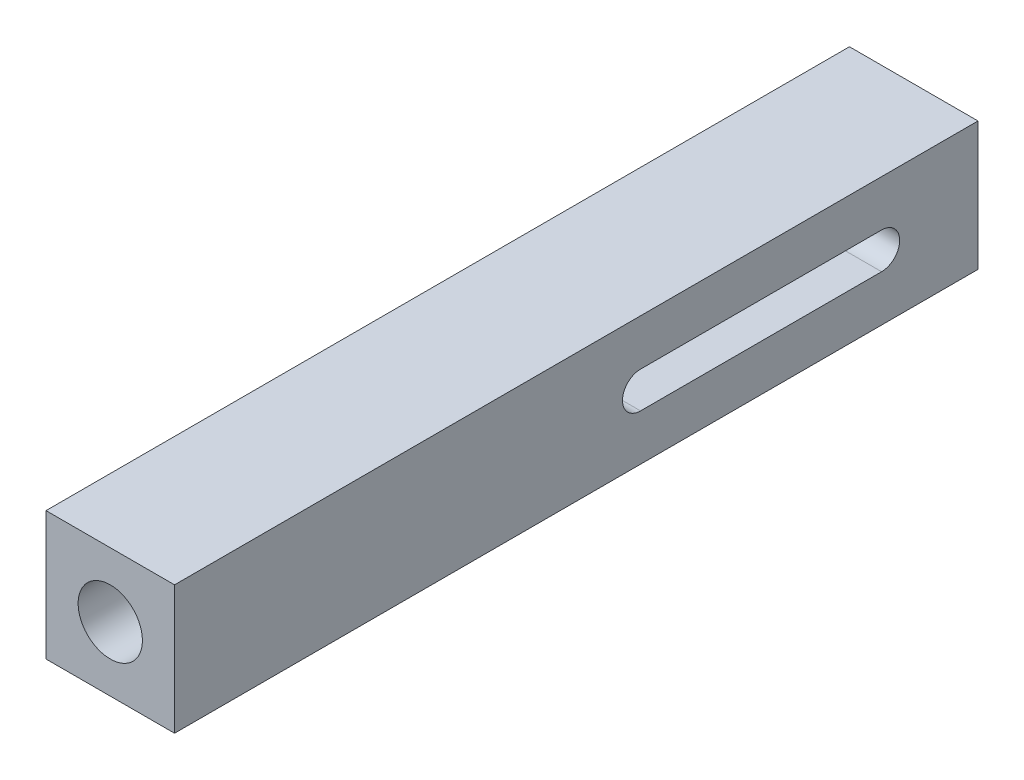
ISO-10303-21;
HEADER;
FILE_DESCRIPTION(('STEP AP214'),'2;1');
FILE_NAME('part.step','',(''),(''),'','','');
FILE_SCHEMA(('AUTOMOTIVE_DESIGN { 1 0 10303 214 1 1 1 1 }'));
ENDSEC;
DATA;
#1=APPLICATION_CONTEXT('core data for automotive mechanical design processes');
#2=APPLICATION_PROTOCOL_DEFINITION('international standard','automotive_design',2000,#1);
#3=PRODUCT_CONTEXT('',#1,'mechanical');
#4=PRODUCT('Part','Part','',(#3));
#5=PRODUCT_RELATED_PRODUCT_CATEGORY('part','',(#4));
#6=PRODUCT_DEFINITION_FORMATION('','',#4);
#7=PRODUCT_DEFINITION_CONTEXT('part definition',#1,'design');
#8=PRODUCT_DEFINITION('design','',#6,#7);
#9=PRODUCT_DEFINITION_SHAPE('','',#8);
#10=(LENGTH_UNIT() NAMED_UNIT(*) SI_UNIT(.MILLI.,.METRE.));
#11=(NAMED_UNIT(*) PLANE_ANGLE_UNIT() SI_UNIT($,.RADIAN.));
#12=(NAMED_UNIT(*) SI_UNIT($,.STERADIAN.) SOLID_ANGLE_UNIT());
#13=UNCERTAINTY_MEASURE_WITH_UNIT(LENGTH_MEASURE(1.E-05),#10,'distance_accuracy_value','');
#14=(GEOMETRIC_REPRESENTATION_CONTEXT(3) GLOBAL_UNCERTAINTY_ASSIGNED_CONTEXT((#13)) GLOBAL_UNIT_ASSIGNED_CONTEXT((#10,
#11,#12)) REPRESENTATION_CONTEXT('',''));
#15=CARTESIAN_POINT('',(0.,0.,0.));
#16=DIRECTION('',(0.,0.,1.));
#17=DIRECTION('',(1.,0.,0.));
#18=AXIS2_PLACEMENT_3D('',#15,#16,#17);
#19=CARTESIAN_POINT('',(0.,0.,100.));
#20=DIRECTION('',(0.,0.,1.));
#21=DIRECTION('',(1.,0.,0.));
#22=AXIS2_PLACEMENT_3D('',#19,#20,#21);
#23=PLANE('',#22);
#24=DIRECTION('',(0.,-1.,0.));
#25=VECTOR('',#24,1.);
#26=CARTESIAN_POINT('',(-8.,-8.,100.));
#27=LINE('',#26,#25);
#28=CARTESIAN_POINT('',(-8.,8.,100.));
#29=VERTEX_POINT('',#28);
#30=CARTESIAN_POINT('',(-8.,-8.,100.));
#31=VERTEX_POINT('',#30);
#32=EDGE_CURVE('E179',#29,#31,#27,.T.);
#33=ORIENTED_EDGE('',*,*,#32,.T.);
#34=DIRECTION('',(1.,0.,0.));
#35=VECTOR('',#34,1.);
#36=CARTESIAN_POINT('',(8.,-8.,100.));
#37=LINE('',#36,#35);
#38=CARTESIAN_POINT('',(8.,-8.,100.));
#39=VERTEX_POINT('',#38);
#40=EDGE_CURVE('E182',#31,#39,#37,.T.);
#41=ORIENTED_EDGE('',*,*,#40,.T.);
#42=DIRECTION('',(0.,1.,0.));
#43=VECTOR('',#42,1.);
#44=CARTESIAN_POINT('',(8.,-8.,100.));
#45=LINE('',#44,#43);
#46=CARTESIAN_POINT('',(8.,8.,100.));
#47=VERTEX_POINT('',#46);
#48=EDGE_CURVE('E185',#39,#47,#45,.T.);
#49=ORIENTED_EDGE('',*,*,#48,.T.);
#50=DIRECTION('',(-1.,0.,0.));
#51=VECTOR('',#50,1.);
#52=CARTESIAN_POINT('',(8.,8.,100.));
#53=LINE('',#52,#51);
#54=EDGE_CURVE('E187',#47,#29,#53,.T.);
#55=ORIENTED_EDGE('',*,*,#54,.T.);
#56=EDGE_LOOP('',(#33,#41,#49,#55));
#57=FACE_BOUND('',#56,.T.);
#58=CARTESIAN_POINT('',(0.,0.,100.));
#59=DIRECTION('',(0.,0.,1.));
#60=DIRECTION('',(1.,0.,0.));
#61=AXIS2_PLACEMENT_3D('',#58,#59,#60);
#62=CIRCLE('',#61,4.);
#63=CARTESIAN_POINT('',(4.,0.,100.));
#64=VERTEX_POINT('',#63);
#65=EDGE_CURVE('E173',#64,#64,#62,.T.);
#66=ORIENTED_EDGE('',*,*,#65,.F.);
#67=EDGE_LOOP('',(#66));
#68=FACE_BOUND('',#67,.T.);
#69=ADVANCED_FACE('F33',(#57,#68),#23,.T.);
#70=CARTESIAN_POINT('',(0.,0.,0.));
#71=DIRECTION('',(0.,0.,1.));
#72=DIRECTION('',(1.,0.,0.));
#73=AXIS2_PLACEMENT_3D('',#70,#71,#72);
#74=PLANE('',#73);
#75=DIRECTION('',(0.,-1.,0.));
#76=VECTOR('',#75,1.);
#77=CARTESIAN_POINT('',(-8.,-8.,0.));
#78=LINE('',#77,#76);
#79=CARTESIAN_POINT('',(-8.,8.,0.));
#80=VERTEX_POINT('',#79);
#81=CARTESIAN_POINT('',(-8.,-8.,0.));
#82=VERTEX_POINT('',#81);
#83=EDGE_CURVE('E176',#80,#82,#78,.T.);
#84=ORIENTED_EDGE('',*,*,#83,.F.);
#85=DIRECTION('',(-1.,0.,0.));
#86=VECTOR('',#85,1.);
#87=CARTESIAN_POINT('',(8.,8.,0.));
#88=LINE('',#87,#86);
#89=CARTESIAN_POINT('',(8.,8.,0.));
#90=VERTEX_POINT('',#89);
#91=EDGE_CURVE('E183',#90,#80,#88,.T.);
#92=ORIENTED_EDGE('',*,*,#91,.F.);
#93=DIRECTION('',(0.,1.,0.));
#94=VECTOR('',#93,1.);
#95=CARTESIAN_POINT('',(8.,-8.,0.));
#96=LINE('',#95,#94);
#97=CARTESIAN_POINT('',(8.,-8.,0.));
#98=VERTEX_POINT('',#97);
#99=EDGE_CURVE('E194',#98,#90,#96,.T.);
#100=ORIENTED_EDGE('',*,*,#99,.F.);
#101=DIRECTION('',(1.,0.,0.));
#102=VECTOR('',#101,1.);
#103=CARTESIAN_POINT('',(8.,-8.,0.));
#104=LINE('',#103,#102);
#105=EDGE_CURVE('E192',#82,#98,#104,.T.);
#106=ORIENTED_EDGE('',*,*,#105,.F.);
#107=EDGE_LOOP('',(#84,#92,#100,#106));
#108=FACE_BOUND('',#107,.T.);
#109=CARTESIAN_POINT('',(0.,0.,0.));
#110=DIRECTION('',(0.,0.,1.));
#111=DIRECTION('',(1.,0.,0.));
#112=AXIS2_PLACEMENT_3D('',#109,#110,#111);
#113=CIRCLE('',#112,4.);
#114=CARTESIAN_POINT('',(4.,0.,0.));
#115=VERTEX_POINT('',#114);
#116=EDGE_CURVE('E166',#115,#115,#113,.T.);
#117=ORIENTED_EDGE('',*,*,#116,.T.);
#118=EDGE_LOOP('',(#117));
#119=FACE_BOUND('',#118,.T.);
#120=ADVANCED_FACE('F260',(#108,#119),#74,.F.);
#121=CARTESIAN_POINT('',(-8.,-8.,100.));
#122=DIRECTION('',(1.,0.,0.));
#123=DIRECTION('',(0.,0.,-1.));
#124=AXIS2_PLACEMENT_3D('',#121,#122,#123);
#125=PLANE('',#124);
#126=DIRECTION('',(0.,0.,1.));
#127=VECTOR('',#126,1.);
#128=CARTESIAN_POINT('',(-8.,2.25,42.));
#129=LINE('',#128,#127);
#130=CARTESIAN_POINT('',(-8.,2.25,12.));
#131=VERTEX_POINT('',#130);
#132=CARTESIAN_POINT('',(-8.,2.25,42.));
#133=VERTEX_POINT('',#132);
#134=EDGE_CURVE('E149',#131,#133,#129,.T.);
#135=ORIENTED_EDGE('',*,*,#134,.T.);
#136=CARTESIAN_POINT('',(-8.,0.,42.));
#137=DIRECTION('',(1.,0.,0.));
#138=DIRECTION('',(0.,0.,-1.));
#139=AXIS2_PLACEMENT_3D('',#136,#137,#138);
#140=CIRCLE('',#139,2.25);
#141=CARTESIAN_POINT('',(-8.,-2.25000000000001,42.));
#142=VERTEX_POINT('',#141);
#143=EDGE_CURVE('E133',#133,#142,#140,.T.);
#144=ORIENTED_EDGE('',*,*,#143,.T.);
#145=DIRECTION('',(0.,0.,-1.));
#146=VECTOR('',#145,1.);
#147=CARTESIAN_POINT('',(-8.,-2.25000000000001,42.));
#148=LINE('',#147,#146);
#149=CARTESIAN_POINT('',(-8.,-2.25,12.));
#150=VERTEX_POINT('',#149);
#151=EDGE_CURVE('E142',#142,#150,#148,.T.);
#152=ORIENTED_EDGE('',*,*,#151,.T.);
#153=CARTESIAN_POINT('',(-8.,0.,12.));
#154=DIRECTION('',(1.,0.,0.));
#155=DIRECTION('',(0.,0.,-1.));
#156=AXIS2_PLACEMENT_3D('',#153,#154,#155);
#157=CIRCLE('',#156,2.25);
#158=EDGE_CURVE('E53',#150,#131,#157,.T.);
#159=ORIENTED_EDGE('',*,*,#158,.T.);
#160=EDGE_LOOP('',(#135,#144,#152,#159));
#161=FACE_BOUND('',#160,.T.);
#162=ORIENTED_EDGE('',*,*,#83,.T.);
#163=DIRECTION('',(0.,0.,-1.));
#164=VECTOR('',#163,1.);
#165=CARTESIAN_POINT('',(-8.,-8.,100.));
#166=LINE('',#165,#164);
#167=EDGE_CURVE('E205',#31,#82,#166,.T.);
#168=ORIENTED_EDGE('',*,*,#167,.F.);
#169=ORIENTED_EDGE('',*,*,#32,.F.);
#170=DIRECTION('',(0.,0.,-1.));
#171=VECTOR('',#170,1.);
#172=CARTESIAN_POINT('',(-8.,8.,100.));
#173=LINE('',#172,#171);
#174=EDGE_CURVE('E189',#29,#80,#173,.T.);
#175=ORIENTED_EDGE('',*,*,#174,.T.);
#176=EDGE_LOOP('',(#162,#168,#169,#175));
#177=FACE_BOUND('',#176,.T.);
#178=ADVANCED_FACE('F35',(#161,#177),#125,.F.);
#179=CARTESIAN_POINT('',(8.,-8.,100.));
#180=DIRECTION('',(0.,1.,0.));
#181=DIRECTION('',(-1.,0.,0.));
#182=AXIS2_PLACEMENT_3D('',#179,#180,#181);
#183=PLANE('',#182);
#184=ORIENTED_EDGE('',*,*,#105,.T.);
#185=DIRECTION('',(0.,0.,-1.));
#186=VECTOR('',#185,1.);
#187=CARTESIAN_POINT('',(8.,-8.,100.));
#188=LINE('',#187,#186);
#189=EDGE_CURVE('E202',#39,#98,#188,.T.);
#190=ORIENTED_EDGE('',*,*,#189,.F.);
#191=ORIENTED_EDGE('',*,*,#40,.F.);
#192=ORIENTED_EDGE('',*,*,#167,.T.);
#193=EDGE_LOOP('',(#184,#190,#191,#192));
#194=FACE_BOUND('',#193,.T.);
#195=ADVANCED_FACE('F275',(#194),#183,.F.);
#196=CARTESIAN_POINT('',(8.,-8.,100.));
#197=DIRECTION('',(-1.,0.,0.));
#198=DIRECTION('',(0.,0.,1.));
#199=AXIS2_PLACEMENT_3D('',#196,#197,#198);
#200=PLANE('',#199);
#201=DIRECTION('',(0.,0.,-1.));
#202=VECTOR('',#201,1.);
#203=CARTESIAN_POINT('',(8.,-2.25000000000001,42.));
#204=LINE('',#203,#202);
#205=CARTESIAN_POINT('',(8.,-2.25000000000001,42.));
#206=VERTEX_POINT('',#205);
#207=CARTESIAN_POINT('',(8.,-2.25,12.));
#208=VERTEX_POINT('',#207);
#209=EDGE_CURVE('E159',#206,#208,#204,.T.);
#210=ORIENTED_EDGE('',*,*,#209,.F.);
#211=CARTESIAN_POINT('',(8.,0.,42.));
#212=DIRECTION('',(1.,0.,0.));
#213=DIRECTION('',(0.,0.,-1.));
#214=AXIS2_PLACEMENT_3D('',#211,#212,#213);
#215=CIRCLE('',#214,2.25);
#216=CARTESIAN_POINT('',(8.,2.25,42.));
#217=VERTEX_POINT('',#216);
#218=EDGE_CURVE('E61',#217,#206,#215,.T.);
#219=ORIENTED_EDGE('',*,*,#218,.F.);
#220=DIRECTION('',(0.,0.,1.));
#221=VECTOR('',#220,1.);
#222=CARTESIAN_POINT('',(8.,2.25,42.));
#223=LINE('',#222,#221);
#224=CARTESIAN_POINT('',(8.,2.25,12.));
#225=VERTEX_POINT('',#224);
#226=EDGE_CURVE('E150',#225,#217,#223,.T.);
#227=ORIENTED_EDGE('',*,*,#226,.F.);
#228=CARTESIAN_POINT('',(8.,0.,12.));
#229=DIRECTION('',(1.,0.,0.));
#230=DIRECTION('',(0.,0.,-1.));
#231=AXIS2_PLACEMENT_3D('',#228,#229,#230);
#232=CIRCLE('',#231,2.25);
#233=EDGE_CURVE('E153',#208,#225,#232,.T.);
#234=ORIENTED_EDGE('',*,*,#233,.F.);
#235=EDGE_LOOP('',(#210,#219,#227,#234));
#236=FACE_BOUND('',#235,.T.);
#237=ORIENTED_EDGE('',*,*,#99,.T.);
#238=DIRECTION('',(0.,0.,-1.));
#239=VECTOR('',#238,1.);
#240=CARTESIAN_POINT('',(8.,8.,100.));
#241=LINE('',#240,#239);
#242=EDGE_CURVE('E199',#47,#90,#241,.T.);
#243=ORIENTED_EDGE('',*,*,#242,.F.);
#244=ORIENTED_EDGE('',*,*,#48,.F.);
#245=ORIENTED_EDGE('',*,*,#189,.T.);
#246=EDGE_LOOP('',(#237,#243,#244,#245));
#247=FACE_BOUND('',#246,.T.);
#248=ADVANCED_FACE('F272',(#236,#247),#200,.F.);
#249=CARTESIAN_POINT('',(8.,8.,100.));
#250=DIRECTION('',(0.,-1.,0.));
#251=DIRECTION('',(1.,0.,0.));
#252=AXIS2_PLACEMENT_3D('',#249,#250,#251);
#253=PLANE('',#252);
#254=ORIENTED_EDGE('',*,*,#91,.T.);
#255=ORIENTED_EDGE('',*,*,#174,.F.);
#256=ORIENTED_EDGE('',*,*,#54,.F.);
#257=ORIENTED_EDGE('',*,*,#242,.T.);
#258=EDGE_LOOP('',(#254,#255,#256,#257));
#259=FACE_BOUND('',#258,.T.);
#260=ADVANCED_FACE('F269',(#259),#253,.F.);
#261=CARTESIAN_POINT('',(0.,0.,100.));
#262=DIRECTION('',(0.,0.,-1.));
#263=DIRECTION('',(-1.,0.,0.));
#264=AXIS2_PLACEMENT_3D('',#261,#262,#263);
#265=CYLINDRICAL_SURFACE('',#264,4.);
#266=CARTESIAN_POINT('',(-3.30718913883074,2.25,42.));
#267=CARTESIAN_POINT('',(-3.30716787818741,2.25001185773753,42.0577125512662));
#268=CARTESIAN_POINT('',(-3.30869926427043,2.24777996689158,42.1154129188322));
#269=CARTESIAN_POINT('',(-3.31470622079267,2.23892257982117,42.2302752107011));
#270=CARTESIAN_POINT('',(-3.31917937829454,2.23230068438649,42.2874375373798));
#271=CARTESIAN_POINT('',(-3.33086768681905,2.2148190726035,42.4004040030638));
#272=CARTESIAN_POINT('',(-3.33806317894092,2.20398972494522,42.4562148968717));
#273=CARTESIAN_POINT('',(-3.35491430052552,2.17825313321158,42.5665008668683));
#274=CARTESIAN_POINT('',(-3.3645703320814,2.1633452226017,42.6209757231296));
#275=CARTESIAN_POINT('',(-3.39667177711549,2.11286872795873,42.781554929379));
#276=CARTESIAN_POINT('',(-3.42230049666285,2.07147734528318,42.8852547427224));
#277=CARTESIAN_POINT('',(-3.47909094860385,1.97460669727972,43.0843147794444));
#278=CARTESIAN_POINT('',(-3.51026361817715,1.91909948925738,43.1796579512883));
#279=CARTESIAN_POINT('',(-3.57858787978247,1.7887620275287,43.3702232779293));
#280=CARTESIAN_POINT('',(-3.61602340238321,1.71251246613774,43.4643753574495));
#281=CARTESIAN_POINT('',(-3.69037015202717,1.54580201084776,43.6393944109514));
#282=CARTESIAN_POINT('',(-3.7272812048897,1.45533651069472,43.7202570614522));
#283=CARTESIAN_POINT('',(-3.80043848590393,1.25271101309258,43.873709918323));
#284=CARTESIAN_POINT('',(-3.83631726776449,1.13932505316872,43.9448737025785));
#285=CARTESIAN_POINT('',(-3.89944551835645,0.899786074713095,44.0666130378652));
#286=CARTESIAN_POINT('',(-3.9267016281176,0.773642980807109,44.1172044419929));
#287=CARTESIAN_POINT('',(-3.96741496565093,0.523682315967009,44.1917496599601));
#288=CARTESIAN_POINT('',(-3.98185952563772,0.400602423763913,44.2176244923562));
#289=CARTESIAN_POINT('',(-3.99909588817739,0.151077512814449,44.2484307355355));
#290=CARTESIAN_POINT('',(-4.00189688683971,0.0246352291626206,44.2533786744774));
#291=CARTESIAN_POINT('',(-3.99589301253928,-0.213147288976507,44.2426914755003));
#292=CARTESIAN_POINT('',(-3.98832416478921,-0.324626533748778,44.2292486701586));
#293=CARTESIAN_POINT('',(-3.96444049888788,-0.543436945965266,44.1862315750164));
#294=CARTESIAN_POINT('',(-3.94812513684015,-0.650767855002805,44.1566562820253));
#295=CARTESIAN_POINT('',(-3.90798974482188,-0.859682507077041,44.0822753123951));
#296=CARTESIAN_POINT('',(-3.88409832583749,-0.961200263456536,44.0373244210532));
#297=CARTESIAN_POINT('',(-3.83081335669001,-1.1554333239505,43.9338041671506));
#298=CARTESIAN_POINT('',(-3.80141814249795,-1.24814595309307,43.875230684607));
#299=CARTESIAN_POINT('',(-3.73587848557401,-1.43313450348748,43.7387534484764));
#300=CARTESIAN_POINT('',(-3.69934709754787,-1.52422336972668,43.6594268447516));
#301=CARTESIAN_POINT('',(-3.6254349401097,-1.69254024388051,43.4873861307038));
#302=CARTESIAN_POINT('',(-3.58805310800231,-1.76974969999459,43.3946543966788));
#303=CARTESIAN_POINT('',(-3.51260135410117,-1.91545866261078,43.1878583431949));
#304=CARTESIAN_POINT('',(-3.4748058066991,-1.98242527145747,43.0726029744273));
#305=CARTESIAN_POINT('',(-3.40783363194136,-2.09547542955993,42.8302176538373));
#306=CARTESIAN_POINT('',(-3.3786310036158,-2.14162220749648,42.7031250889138));
#307=CARTESIAN_POINT('',(-3.34054928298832,-2.20035516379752,42.4796115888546));
#308=CARTESIAN_POINT('',(-3.3282076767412,-2.21884315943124,42.3853277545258));
#309=CARTESIAN_POINT('',(-3.31568780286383,-2.23746879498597,42.2420198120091));
#310=CARTESIAN_POINT('',(-3.31251289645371,-2.24215984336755,42.1938137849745));
#311=CARTESIAN_POINT('',(-3.30825879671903,-2.24842833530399,42.0970776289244));
#312=CARTESIAN_POINT('',(-3.30718093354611,-2.25000380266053,42.0485473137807));
#313=CARTESIAN_POINT('',(-3.30718913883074,-2.25000000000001,42.));
#314=B_SPLINE_CURVE_WITH_KNOTS('',3,(#266,#267,#268,#269,#270,#271,#272,#273,#274,#275,#276,
#277,#278,#279,#280,#281,#282,#283,#284,#285,#286,#287,#288,#289,#290,#291,#292,#293,#294,#295,
#296,#297,#298,#299,#300,#301,#302,#303,#304,#305,#306,#307,#308,#309,#310,#311,#312,#313),
.UNSPECIFIED.,.F.,.F.,(4,2,2,2,2,2,2,2,2,2,2,2,2,2,2,2,2,2,2,2,2,2,2,4),(0.,0.173054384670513,
0.345967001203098,0.517654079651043,0.689369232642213,1.03146915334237,1.3742516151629,
1.75313175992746,2.13213492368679,2.54569337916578,2.9589325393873,3.3365326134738,
3.71383440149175,4.0498639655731,4.38591442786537,4.725230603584,5.06464953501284,
5.4416836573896,5.81921805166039,6.23275751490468,6.64503248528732,6.93453262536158,
7.0800126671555,7.22558495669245),.UNSPECIFIED.);
#315=CARTESIAN_POINT('',(-3.30718913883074,2.25,42.));
#316=VERTEX_POINT('',#315);
#317=CARTESIAN_POINT('',(-3.30718913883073,-2.25000000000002,42.));
#318=VERTEX_POINT('',#317);
#319=EDGE_CURVE('E11',#316,#318,#314,.T.);
#320=ORIENTED_EDGE('',*,*,#319,.F.);
#321=DIRECTION('',(0.,0.,-1.));
#322=VECTOR('',#321,1.);
#323=CARTESIAN_POINT('',(-3.30718913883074,2.24999999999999,100.));
#324=LINE('',#323,#322);
#325=CARTESIAN_POINT('',(-3.30718913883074,2.25,12.));
#326=VERTEX_POINT('',#325);
#327=EDGE_CURVE('E46',#326,#316,#324,.F.);
#328=ORIENTED_EDGE('',*,*,#327,.F.);
#329=CARTESIAN_POINT('',(-3.30718913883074,-2.25,12.));
#330=CARTESIAN_POINT('',(-3.30716787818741,-2.25001185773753,11.9422874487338));
#331=CARTESIAN_POINT('',(-3.30869926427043,-2.24777996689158,11.8845870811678));
#332=CARTESIAN_POINT('',(-3.31470622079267,-2.23892257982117,11.7697247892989));
#333=CARTESIAN_POINT('',(-3.31917937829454,-2.23230068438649,11.7125624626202));
#334=CARTESIAN_POINT('',(-3.33086768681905,-2.21481907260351,11.5995959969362));
#335=CARTESIAN_POINT('',(-3.33806317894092,-2.20398972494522,11.5437851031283));
#336=CARTESIAN_POINT('',(-3.35491430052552,-2.17825313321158,11.4334991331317));
#337=CARTESIAN_POINT('',(-3.3645703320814,-2.16334522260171,11.3790242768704));
#338=CARTESIAN_POINT('',(-3.39667177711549,-2.11286872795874,11.218445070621));
#339=CARTESIAN_POINT('',(-3.42230049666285,-2.07147734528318,11.1147452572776));
#340=CARTESIAN_POINT('',(-3.47909094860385,-1.97460669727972,10.9156852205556));
#341=CARTESIAN_POINT('',(-3.51026361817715,-1.91909948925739,10.8203420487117));
#342=CARTESIAN_POINT('',(-3.57858787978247,-1.78876202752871,10.6297767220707));
#343=CARTESIAN_POINT('',(-3.61602340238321,-1.71251246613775,10.5356246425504));
#344=CARTESIAN_POINT('',(-3.69037015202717,-1.54580201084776,10.3606055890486));
#345=CARTESIAN_POINT('',(-3.7272812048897,-1.45533651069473,10.2797429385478));
#346=CARTESIAN_POINT('',(-3.80043848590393,-1.25271101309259,10.126290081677));
#347=CARTESIAN_POINT('',(-3.83631726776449,-1.13932505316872,10.0551262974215));
#348=CARTESIAN_POINT('',(-3.89944551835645,-0.899786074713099,9.9333869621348));
#349=CARTESIAN_POINT('',(-3.9267016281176,-0.773642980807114,9.88279555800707));
#350=CARTESIAN_POINT('',(-3.96741496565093,-0.523682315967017,9.80825034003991));
#351=CARTESIAN_POINT('',(-3.98185952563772,-0.400602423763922,9.78237550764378));
#352=CARTESIAN_POINT('',(-3.99909588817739,-0.151077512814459,9.75156926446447));
#353=CARTESIAN_POINT('',(-4.00189688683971,-0.0246352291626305,9.74662132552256));
#354=CARTESIAN_POINT('',(-3.99589301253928,0.213147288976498,9.75730852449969));
#355=CARTESIAN_POINT('',(-3.98832416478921,0.324626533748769,9.77075132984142));
#356=CARTESIAN_POINT('',(-3.96444049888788,0.543436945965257,9.81376842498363));
#357=CARTESIAN_POINT('',(-3.94812513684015,0.650767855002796,9.84334371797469));
#358=CARTESIAN_POINT('',(-3.90798974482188,0.859682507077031,9.91772468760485));
#359=CARTESIAN_POINT('',(-3.88409832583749,0.961200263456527,9.96267557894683));
#360=CARTESIAN_POINT('',(-3.83081335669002,1.15543332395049,10.0661958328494));
#361=CARTESIAN_POINT('',(-3.80141814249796,1.24814595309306,10.124769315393));
#362=CARTESIAN_POINT('',(-3.73587848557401,1.43313450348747,10.2612465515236));
#363=CARTESIAN_POINT('',(-3.69934709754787,1.52422336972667,10.3405731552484));
#364=CARTESIAN_POINT('',(-3.62543494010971,1.6925402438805,10.5126138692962));
#365=CARTESIAN_POINT('',(-3.58805310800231,1.76974969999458,10.6053456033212));
#366=CARTESIAN_POINT('',(-3.51260135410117,1.91545866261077,10.8121416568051));
#367=CARTESIAN_POINT('',(-3.4748058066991,1.98242527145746,10.9273970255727));
#368=CARTESIAN_POINT('',(-3.40783363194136,2.09547542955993,11.1697823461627));
#369=CARTESIAN_POINT('',(-3.37863100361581,2.14162220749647,11.2968749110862));
#370=CARTESIAN_POINT('',(-3.34054928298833,2.20035516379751,11.5203884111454));
#371=CARTESIAN_POINT('',(-3.32820767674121,2.21884315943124,11.6146722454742));
#372=CARTESIAN_POINT('',(-3.31568780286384,2.23746879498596,11.7579801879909));
#373=CARTESIAN_POINT('',(-3.31251289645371,2.24215984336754,11.8061862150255));
#374=CARTESIAN_POINT('',(-3.30825879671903,2.24842833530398,11.9029223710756));
#375=CARTESIAN_POINT('',(-3.30718093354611,2.25000380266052,11.9514526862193));
#376=CARTESIAN_POINT('',(-3.30718913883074,2.25,12.));
#377=B_SPLINE_CURVE_WITH_KNOTS('',3,(#329,#330,#331,#332,#333,#334,#335,#336,#337,#338,#339,
#340,#341,#342,#343,#344,#345,#346,#347,#348,#349,#350,#351,#352,#353,#354,#355,#356,#357,#358,
#359,#360,#361,#362,#363,#364,#365,#366,#367,#368,#369,#370,#371,#372,#373,#374,#375,#376),
.UNSPECIFIED.,.F.,.F.,(4,2,2,2,2,2,2,2,2,2,2,2,2,2,2,2,2,2,2,2,2,2,2,4),(0.,0.173054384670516,
0.34596700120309,0.51765407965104,0.689369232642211,1.03146915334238,1.3742516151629,
1.75313175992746,2.13213492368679,2.54569337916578,2.95893253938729,3.33653261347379,
3.71383440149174,4.0498639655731,4.38591442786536,4.725230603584,5.06464953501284,
5.4416836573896,5.81921805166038,6.23275751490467,6.64503248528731,6.93453262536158,
7.0800126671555,7.22558495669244),.UNSPECIFIED.);
#378=CARTESIAN_POINT('',(-3.30718913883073,-2.25,12.));
#379=VERTEX_POINT('',#378);
#380=EDGE_CURVE('E232',#379,#326,#377,.T.);
#381=ORIENTED_EDGE('',*,*,#380,.F.);
#382=DIRECTION('',(0.,0.,-1.));
#383=VECTOR('',#382,1.);
#384=CARTESIAN_POINT('',(-3.30718913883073,-2.25000000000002,100.));
#385=LINE('',#384,#383);
#386=EDGE_CURVE('E237',#318,#379,#385,.T.);
#387=ORIENTED_EDGE('',*,*,#386,.F.);
#388=EDGE_LOOP('',(#320,#328,#381,#387));
#389=FACE_BOUND('',#388,.T.);
#390=CARTESIAN_POINT('',(3.30718913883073,-2.25000000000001,42.));
#391=CARTESIAN_POINT('',(3.3071678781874,-2.25001185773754,42.0577125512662));
#392=CARTESIAN_POINT('',(3.30869926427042,-2.24777996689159,42.1154129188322));
#393=CARTESIAN_POINT('',(3.31470622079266,-2.23892257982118,42.2302752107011));
#394=CARTESIAN_POINT('',(3.31917937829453,-2.2323006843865,42.2874375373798));
#395=CARTESIAN_POINT('',(3.33086768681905,-2.21481907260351,42.4004040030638));
#396=CARTESIAN_POINT('',(3.33806317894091,-2.20398972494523,42.4562148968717));
#397=CARTESIAN_POINT('',(3.35491430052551,-2.17825313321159,42.5665008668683));
#398=CARTESIAN_POINT('',(3.3645703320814,-2.16334522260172,42.6209757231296));
#399=CARTESIAN_POINT('',(3.39667177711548,-2.11286872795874,42.781554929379));
#400=CARTESIAN_POINT('',(3.42230049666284,-2.07147734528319,42.8852547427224));
#401=CARTESIAN_POINT('',(3.47909094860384,-1.97460669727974,43.0843147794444));
#402=CARTESIAN_POINT('',(3.51026361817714,-1.9190994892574,43.1796579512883));
#403=CARTESIAN_POINT('',(3.57858787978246,-1.78876202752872,43.3702232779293));
#404=CARTESIAN_POINT('',(3.6160234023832,-1.71251246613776,43.4643753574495));
#405=CARTESIAN_POINT('',(3.69037015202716,-1.54580201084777,43.6393944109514));
#406=CARTESIAN_POINT('',(3.7272812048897,-1.45533651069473,43.7202570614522));
#407=CARTESIAN_POINT('',(3.80043848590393,-1.25271101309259,43.873709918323));
#408=CARTESIAN_POINT('',(3.83631726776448,-1.13932505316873,43.9448737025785));
#409=CARTESIAN_POINT('',(3.89944551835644,-0.899786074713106,44.0666130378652));
#410=CARTESIAN_POINT('',(3.92670162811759,-0.773642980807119,44.1172044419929));
#411=CARTESIAN_POINT('',(3.96741496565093,-0.523682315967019,44.1917496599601));
#412=CARTESIAN_POINT('',(3.98185952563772,-0.400602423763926,44.2176244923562));
#413=CARTESIAN_POINT('',(3.99909588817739,-0.151077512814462,44.2484307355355));
#414=CARTESIAN_POINT('',(4.00189688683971,-0.0246352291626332,44.2533786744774));
#415=CARTESIAN_POINT('',(3.99589301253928,0.213147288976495,44.2426914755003));
#416=CARTESIAN_POINT('',(3.98832416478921,0.324626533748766,44.2292486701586));
#417=CARTESIAN_POINT('',(3.96444049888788,0.543436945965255,44.1862315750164));
#418=CARTESIAN_POINT('',(3.94812513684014,0.650767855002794,44.1566562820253));
#419=CARTESIAN_POINT('',(3.90798974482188,0.85968250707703,44.0822753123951));
#420=CARTESIAN_POINT('',(3.88409832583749,0.961200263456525,44.0373244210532));
#421=CARTESIAN_POINT('',(3.83081335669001,1.15543332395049,43.9338041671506));
#422=CARTESIAN_POINT('',(3.80141814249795,1.24814595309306,43.875230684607));
#423=CARTESIAN_POINT('',(3.73587848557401,1.43313450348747,43.7387534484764));
#424=CARTESIAN_POINT('',(3.69934709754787,1.52422336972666,43.6594268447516));
#425=CARTESIAN_POINT('',(3.6254349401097,1.6925402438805,43.4873861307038));
#426=CARTESIAN_POINT('',(3.5880531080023,1.76974969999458,43.3946543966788));
#427=CARTESIAN_POINT('',(3.51260135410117,1.91545866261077,43.1878583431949));
#428=CARTESIAN_POINT('',(3.4748058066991,1.98242527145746,43.0726029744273));
#429=CARTESIAN_POINT('',(3.40783363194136,2.09547542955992,42.8302176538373));
#430=CARTESIAN_POINT('',(3.37863100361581,2.14162220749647,42.7031250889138));
#431=CARTESIAN_POINT('',(3.34054928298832,2.20035516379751,42.4796115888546));
#432=CARTESIAN_POINT('',(3.3282076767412,2.21884315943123,42.3853277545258));
#433=CARTESIAN_POINT('',(3.31568780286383,2.23746879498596,42.2420198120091));
#434=CARTESIAN_POINT('',(3.31251289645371,2.24215984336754,42.1938137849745));
#435=CARTESIAN_POINT('',(3.30825879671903,2.24842833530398,42.0970776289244));
#436=CARTESIAN_POINT('',(3.30718093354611,2.25000380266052,42.0485473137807));
#437=CARTESIAN_POINT('',(3.30718913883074,2.25,42.));
#438=B_SPLINE_CURVE_WITH_KNOTS('',3,(#390,#391,#392,#393,#394,#395,#396,#397,#398,#399,#400,
#401,#402,#403,#404,#405,#406,#407,#408,#409,#410,#411,#412,#413,#414,#415,#416,#417,#418,#419,
#420,#421,#422,#423,#424,#425,#426,#427,#428,#429,#430,#431,#432,#433,#434,#435,#436,#437),
.UNSPECIFIED.,.F.,.F.,(4,2,2,2,2,2,2,2,2,2,2,2,2,2,2,2,2,2,2,2,2,2,2,4),(0.,0.173054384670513,
0.345967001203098,0.517654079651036,0.689369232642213,1.03146915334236,1.37425161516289,
1.75313175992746,2.13213492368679,2.54569337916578,2.9589325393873,3.33653261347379,
3.71383440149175,4.0498639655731,4.38591442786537,4.725230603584,5.06464953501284,
5.4416836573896,5.81921805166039,6.23275751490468,6.64503248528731,6.93453262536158,
7.0800126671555,7.22558495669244),.UNSPECIFIED.);
#439=CARTESIAN_POINT('',(3.30718913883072,-2.25000000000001,42.));
#440=VERTEX_POINT('',#439);
#441=CARTESIAN_POINT('',(3.30718913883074,2.25,42.));
#442=VERTEX_POINT('',#441);
#443=EDGE_CURVE('E243',#440,#442,#438,.T.);
#444=ORIENTED_EDGE('',*,*,#443,.F.);
#445=DIRECTION('',(0.,0.,-1.));
#446=VECTOR('',#445,1.);
#447=CARTESIAN_POINT('',(3.30718913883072,-2.25000000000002,100.));
#448=LINE('',#447,#446);
#449=CARTESIAN_POINT('',(3.30718913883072,-2.25000000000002,12.));
#450=VERTEX_POINT('',#449);
#451=EDGE_CURVE('E208',#450,#440,#448,.F.);
#452=ORIENTED_EDGE('',*,*,#451,.F.);
#453=CARTESIAN_POINT('',(3.30718913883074,2.25,12.));
#454=CARTESIAN_POINT('',(3.3071678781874,2.25001185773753,11.9422874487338));
#455=CARTESIAN_POINT('',(3.30869926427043,2.24777996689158,11.8845870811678));
#456=CARTESIAN_POINT('',(3.31470622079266,2.23892257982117,11.7697247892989));
#457=CARTESIAN_POINT('',(3.31917937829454,2.23230068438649,11.7125624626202));
#458=CARTESIAN_POINT('',(3.33086768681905,2.21481907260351,11.5995959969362));
#459=CARTESIAN_POINT('',(3.33806317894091,2.20398972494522,11.5437851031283));
#460=CARTESIAN_POINT('',(3.35491430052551,2.17825313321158,11.4334991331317));
#461=CARTESIAN_POINT('',(3.3645703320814,2.16334522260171,11.3790242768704));
#462=CARTESIAN_POINT('',(3.39667177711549,2.11286872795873,11.218445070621));
#463=CARTESIAN_POINT('',(3.42230049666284,2.07147734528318,11.1147452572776));
#464=CARTESIAN_POINT('',(3.47909094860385,1.97460669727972,10.9156852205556));
#465=CARTESIAN_POINT('',(3.51026361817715,1.91909948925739,10.8203420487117));
#466=CARTESIAN_POINT('',(3.57858787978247,1.78876202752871,10.6297767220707));
#467=CARTESIAN_POINT('',(3.6160234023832,1.71251246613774,10.5356246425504));
#468=CARTESIAN_POINT('',(3.69037015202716,1.54580201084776,10.3606055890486));
#469=CARTESIAN_POINT('',(3.7272812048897,1.45533651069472,10.2797429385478));
#470=CARTESIAN_POINT('',(3.80043848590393,1.25271101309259,10.126290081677));
#471=CARTESIAN_POINT('',(3.83631726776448,1.13932505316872,10.0551262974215));
#472=CARTESIAN_POINT('',(3.89944551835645,0.899786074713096,9.9333869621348));
#473=CARTESIAN_POINT('',(3.92670162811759,0.773642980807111,9.88279555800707));
#474=CARTESIAN_POINT('',(3.96741496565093,0.523682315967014,9.80825034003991));
#475=CARTESIAN_POINT('',(3.98185952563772,0.400602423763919,9.78237550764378));
#476=CARTESIAN_POINT('',(3.99909588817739,0.151077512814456,9.75156926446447));
#477=CARTESIAN_POINT('',(4.00189688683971,0.0246352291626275,9.74662132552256));
#478=CARTESIAN_POINT('',(3.99589301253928,-0.213147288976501,9.75730852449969));
#479=CARTESIAN_POINT('',(3.98832416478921,-0.324626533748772,9.77075132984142));
#480=CARTESIAN_POINT('',(3.96444049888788,-0.54343694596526,9.81376842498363));
#481=CARTESIAN_POINT('',(3.94812513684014,-0.650767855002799,9.84334371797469));
#482=CARTESIAN_POINT('',(3.90798974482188,-0.859682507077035,9.91772468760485));
#483=CARTESIAN_POINT('',(3.88409832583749,-0.96120026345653,9.96267557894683));
#484=CARTESIAN_POINT('',(3.83081335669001,-1.15543332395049,10.0661958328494));
#485=CARTESIAN_POINT('',(3.80141814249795,-1.24814595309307,10.124769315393));
#486=CARTESIAN_POINT('',(3.73587848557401,-1.43313450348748,10.2612465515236));
#487=CARTESIAN_POINT('',(3.69934709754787,-1.52422336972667,10.3405731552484));
#488=CARTESIAN_POINT('',(3.6254349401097,-1.69254024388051,10.5126138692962));
#489=CARTESIAN_POINT('',(3.5880531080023,-1.76974969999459,10.6053456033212));
#490=CARTESIAN_POINT('',(3.51260135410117,-1.91545866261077,10.8121416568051));
#491=CARTESIAN_POINT('',(3.47480580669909,-1.98242527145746,10.9273970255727));
#492=CARTESIAN_POINT('',(3.40783363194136,-2.09547542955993,11.1697823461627));
#493=CARTESIAN_POINT('',(3.37863100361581,-2.14162220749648,11.2968749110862));
#494=CARTESIAN_POINT('',(3.34054928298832,-2.20035516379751,11.5203884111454));
#495=CARTESIAN_POINT('',(3.3282076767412,-2.21884315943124,11.6146722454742));
#496=CARTESIAN_POINT('',(3.31568780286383,-2.23746879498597,11.7579801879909));
#497=CARTESIAN_POINT('',(3.31251289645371,-2.24215984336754,11.8061862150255));
#498=CARTESIAN_POINT('',(3.30825879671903,-2.24842833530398,11.9029223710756));
#499=CARTESIAN_POINT('',(3.30718093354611,-2.25000380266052,11.9514526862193));
#500=CARTESIAN_POINT('',(3.30718913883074,-2.25,12.));
#501=B_SPLINE_CURVE_WITH_KNOTS('',3,(#453,#454,#455,#456,#457,#458,#459,#460,#461,#462,#463,
#464,#465,#466,#467,#468,#469,#470,#471,#472,#473,#474,#475,#476,#477,#478,#479,#480,#481,#482,
#483,#484,#485,#486,#487,#488,#489,#490,#491,#492,#493,#494,#495,#496,#497,#498,#499,#500),
.UNSPECIFIED.,.F.,.F.,(4,2,2,2,2,2,2,2,2,2,2,2,2,2,2,2,2,2,2,2,2,2,2,4),(0.,0.173054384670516,
0.34596700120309,0.517654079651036,0.689369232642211,1.03146915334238,1.3742516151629,
1.75313175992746,2.13213492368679,2.54569337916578,2.95893253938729,3.33653261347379,
3.71383440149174,4.0498639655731,4.38591442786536,4.725230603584,5.06464953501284,
5.4416836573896,5.81921805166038,6.23275751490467,6.64503248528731,6.93453262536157,
7.0800126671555,7.22558495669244),.UNSPECIFIED.);
#502=CARTESIAN_POINT('',(3.30718913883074,2.25,12.));
#503=VERTEX_POINT('',#502);
#504=EDGE_CURVE('E210',#503,#450,#501,.T.);
#505=ORIENTED_EDGE('',*,*,#504,.F.);
#506=DIRECTION('',(0.,0.,-1.));
#507=VECTOR('',#506,1.);
#508=CARTESIAN_POINT('',(3.30718913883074,2.24999999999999,100.));
#509=LINE('',#508,#507);
#510=EDGE_CURVE('E217',#442,#503,#509,.T.);
#511=ORIENTED_EDGE('',*,*,#510,.F.);
#512=EDGE_LOOP('',(#444,#452,#505,#511));
#513=FACE_BOUND('',#512,.T.);
#514=ORIENTED_EDGE('',*,*,#65,.T.);
#515=EDGE_LOOP('',(#514));
#516=FACE_BOUND('',#515,.T.);
#517=ORIENTED_EDGE('',*,*,#116,.F.);
#518=EDGE_LOOP('',(#517));
#519=FACE_BOUND('',#518,.T.);
#520=ADVANCED_FACE('F219',(#389,#513,#516,#519),#265,.F.);
#521=CARTESIAN_POINT('',(-8.,-2.25000000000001,42.));
#522=DIRECTION('',(0.,-1.,0.));
#523=DIRECTION('',(0.,0.,-1.));
#524=AXIS2_PLACEMENT_3D('',#521,#522,#523);
#525=PLANE('',#524);
#526=ORIENTED_EDGE('',*,*,#451,.T.);
#527=DIRECTION('',(1.,0.,0.));
#528=VECTOR('',#527,1.);
#529=CARTESIAN_POINT('',(-8.,-2.25000000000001,42.));
#530=LINE('',#529,#528);
#531=EDGE_CURVE('E139',#440,#206,#530,.T.);
#532=ORIENTED_EDGE('',*,*,#531,.T.);
#533=ORIENTED_EDGE('',*,*,#209,.T.);
#534=DIRECTION('',(1.,0.,0.));
#535=VECTOR('',#534,1.);
#536=CARTESIAN_POINT('',(-8.,-2.25,12.));
#537=LINE('',#536,#535);
#538=EDGE_CURVE('E138',#450,#208,#537,.T.);
#539=ORIENTED_EDGE('',*,*,#538,.F.);
#540=EDGE_LOOP('',(#526,#532,#533,#539));
#541=FACE_BOUND('',#540,.T.);
#542=ADVANCED_FACE('F229',(#541),#525,.F.);
#543=CARTESIAN_POINT('',(-8.,0.,12.));
#544=DIRECTION('',(1.,0.,0.));
#545=DIRECTION('',(0.,0.,-1.));
#546=AXIS2_PLACEMENT_3D('',#543,#544,#545);
#547=CYLINDRICAL_SURFACE('',#546,2.25);
#548=ORIENTED_EDGE('',*,*,#504,.T.);
#549=ORIENTED_EDGE('',*,*,#538,.T.);
#550=ORIENTED_EDGE('',*,*,#233,.T.);
#551=DIRECTION('',(1.,0.,0.));
#552=VECTOR('',#551,1.);
#553=CARTESIAN_POINT('',(-8.,2.25,12.));
#554=LINE('',#553,#552);
#555=EDGE_CURVE('E171',#503,#225,#554,.T.);
#556=ORIENTED_EDGE('',*,*,#555,.F.);
#557=EDGE_LOOP('',(#548,#549,#550,#556));
#558=FACE_BOUND('',#557,.T.);
#559=ADVANCED_FACE('F228',(#558),#547,.F.);
#560=CARTESIAN_POINT('',(-8.,2.25,42.));
#561=DIRECTION('',(0.,1.,0.));
#562=DIRECTION('',(0.,0.,1.));
#563=AXIS2_PLACEMENT_3D('',#560,#561,#562);
#564=PLANE('',#563);
#565=ORIENTED_EDGE('',*,*,#510,.T.);
#566=ORIENTED_EDGE('',*,*,#555,.T.);
#567=ORIENTED_EDGE('',*,*,#226,.T.);
#568=DIRECTION('',(1.,0.,0.));
#569=VECTOR('',#568,1.);
#570=CARTESIAN_POINT('',(-8.,2.25,42.));
#571=LINE('',#570,#569);
#572=EDGE_CURVE('E167',#442,#217,#571,.T.);
#573=ORIENTED_EDGE('',*,*,#572,.F.);
#574=EDGE_LOOP('',(#565,#566,#567,#573));
#575=FACE_BOUND('',#574,.T.);
#576=ADVANCED_FACE('F257',(#575),#564,.F.);
#577=CARTESIAN_POINT('',(-8.,0.,42.));
#578=DIRECTION('',(1.,0.,0.));
#579=DIRECTION('',(0.,0.,-1.));
#580=AXIS2_PLACEMENT_3D('',#577,#578,#579);
#581=CYLINDRICAL_SURFACE('',#580,2.25);
#582=ORIENTED_EDGE('',*,*,#443,.T.);
#583=ORIENTED_EDGE('',*,*,#572,.T.);
#584=ORIENTED_EDGE('',*,*,#218,.T.);
#585=ORIENTED_EDGE('',*,*,#531,.F.);
#586=EDGE_LOOP('',(#582,#583,#584,#585));
#587=FACE_BOUND('',#586,.T.);
#588=ADVANCED_FACE('F251',(#587),#581,.F.);
#589=ORIENTED_EDGE('',*,*,#386,.T.);
#590=EDGE_CURVE('E144',#150,#379,#537,.T.);
#591=ORIENTED_EDGE('',*,*,#590,.F.);
#592=ORIENTED_EDGE('',*,*,#151,.F.);
#593=EDGE_CURVE('E128',#142,#318,#530,.T.);
#594=ORIENTED_EDGE('',*,*,#593,.T.);
#595=EDGE_LOOP('',(#589,#591,#592,#594));
#596=FACE_BOUND('',#595,.T.);
#597=ADVANCED_FACE('F143',(#596),#525,.F.);
#598=ORIENTED_EDGE('',*,*,#319,.T.);
#599=ORIENTED_EDGE('',*,*,#593,.F.);
#600=ORIENTED_EDGE('',*,*,#143,.F.);
#601=EDGE_CURVE('E164',#133,#316,#571,.T.);
#602=ORIENTED_EDGE('',*,*,#601,.T.);
#603=EDGE_LOOP('',(#598,#599,#600,#602));
#604=FACE_BOUND('',#603,.T.);
#605=ADVANCED_FACE('F130',(#604),#581,.F.);
#606=ORIENTED_EDGE('',*,*,#327,.T.);
#607=ORIENTED_EDGE('',*,*,#601,.F.);
#608=ORIENTED_EDGE('',*,*,#134,.F.);
#609=EDGE_CURVE('E168',#131,#326,#554,.T.);
#610=ORIENTED_EDGE('',*,*,#609,.T.);
#611=EDGE_LOOP('',(#606,#607,#608,#610));
#612=FACE_BOUND('',#611,.T.);
#613=ADVANCED_FACE('F227',(#612),#564,.F.);
#614=ORIENTED_EDGE('',*,*,#380,.T.);
#615=ORIENTED_EDGE('',*,*,#609,.F.);
#616=ORIENTED_EDGE('',*,*,#158,.F.);
#617=ORIENTED_EDGE('',*,*,#590,.T.);
#618=EDGE_LOOP('',(#614,#615,#616,#617));
#619=FACE_BOUND('',#618,.T.);
#620=ADVANCED_FACE('F222',(#619),#547,.F.);
#621=CLOSED_SHELL('',(#69,#120,#178,#195,#248,#260,#520,#542,#559,#576,#588,#597,#605,#613,#620));
#622=MANIFOLD_SOLID_BREP('B2',#621);
#623=ADVANCED_BREP_SHAPE_REPRESENTATION('',(#18,#622),#14);
#624=SHAPE_DEFINITION_REPRESENTATION(#9,#623);
ENDSEC;
END-ISO-10303-21;
